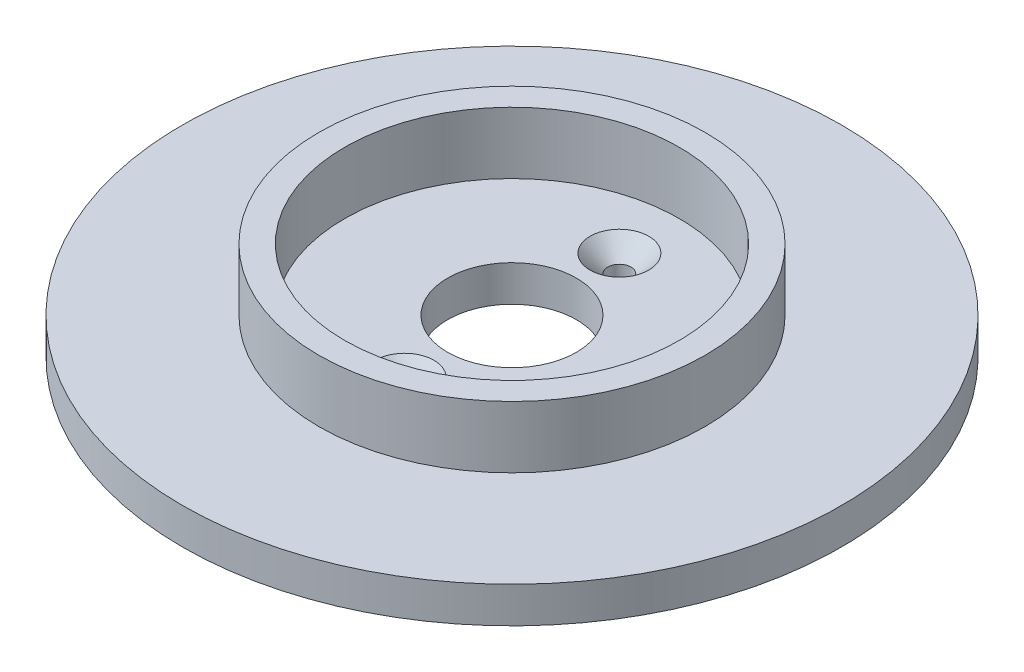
from build123d import *

# Parameters (mm, degrees)
SKETCH1_R                                       = 64
EXTRUDE1_DEPTH                                  = 7
SKETCH2_R                                       = 37.5
SKETCH2_R_2                                     = 32.5
EXTRUDE2_DEPTH                                  = 12
SKETCH6_R                                       = 12.5
EXTRUDE6_DEPTH                                  = 92.301697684
CSK_FOR_M4_FLAT_HEAD_MACHINE_SCREW1_D           = 4.5
CSK_FOR_M4_FLAT_HEAD_MACHINE_SCREW1_CSINK_D     = 11.4
CSK_FOR_M4_FLAT_HEAD_MACHINE_SCREW1_CSINK_ANGLE = 90


with BuildPart() as part:
    # Sketch1 → Extrude1 (new body)
    with BuildSketch(Plane(origin=(0, 0, 0), x_dir=(1, 0, 0), z_dir=(0, 1, 0))):
        with Locations(Location((0, 0, 0), (0, 0, 270))):
            Circle(SKETCH1_R)
    extrude(amount=EXTRUDE1_DEPTH)

    # Sketch2 → Extrude2 (add)
    with BuildSketch(Plane(origin=(0, 7, 0), x_dir=(1, 0, 0), z_dir=(0, 1, 0))):
        with Locations(Location((0, 0, 0), (0, 0, 270))):
            Circle(SKETCH2_R)
        with Locations(Location((0, 0, 0), (0, 0, 270))):
            Circle(SKETCH2_R_2, mode=Mode.SUBTRACT)
    extrude(amount=EXTRUDE2_DEPTH)

    # Sketch6 → Extrude6 (cut, through all)
    with BuildSketch(Plane(origin=(0, 7, 0), x_dir=(1, 0, 0), z_dir=(0, 1, 0))):
        with Locations(Location((0, 0, 0), (0, 0, 270))):
            Circle(SKETCH6_R)
    extrude(amount=-EXTRUDE6_DEPTH, mode=Mode.SUBTRACT)

    # CSK for M4 Flat Head Machine Screw1 (through all)
    with Locations(Plane(origin=(0, 7, -20.856653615), x_dir=(0, 0, 1), z_dir=(0, 1, 0))):
        with Locations((0, 0), (41.71330723, 0)):
            CounterSinkHole(CSK_FOR_M4_FLAT_HEAD_MACHINE_SCREW1_D / 2, CSK_FOR_M4_FLAT_HEAD_MACHINE_SCREW1_CSINK_D / 2, counter_sink_angle=CSK_FOR_M4_FLAT_HEAD_MACHINE_SCREW1_CSINK_ANGLE)


solid = part.part
